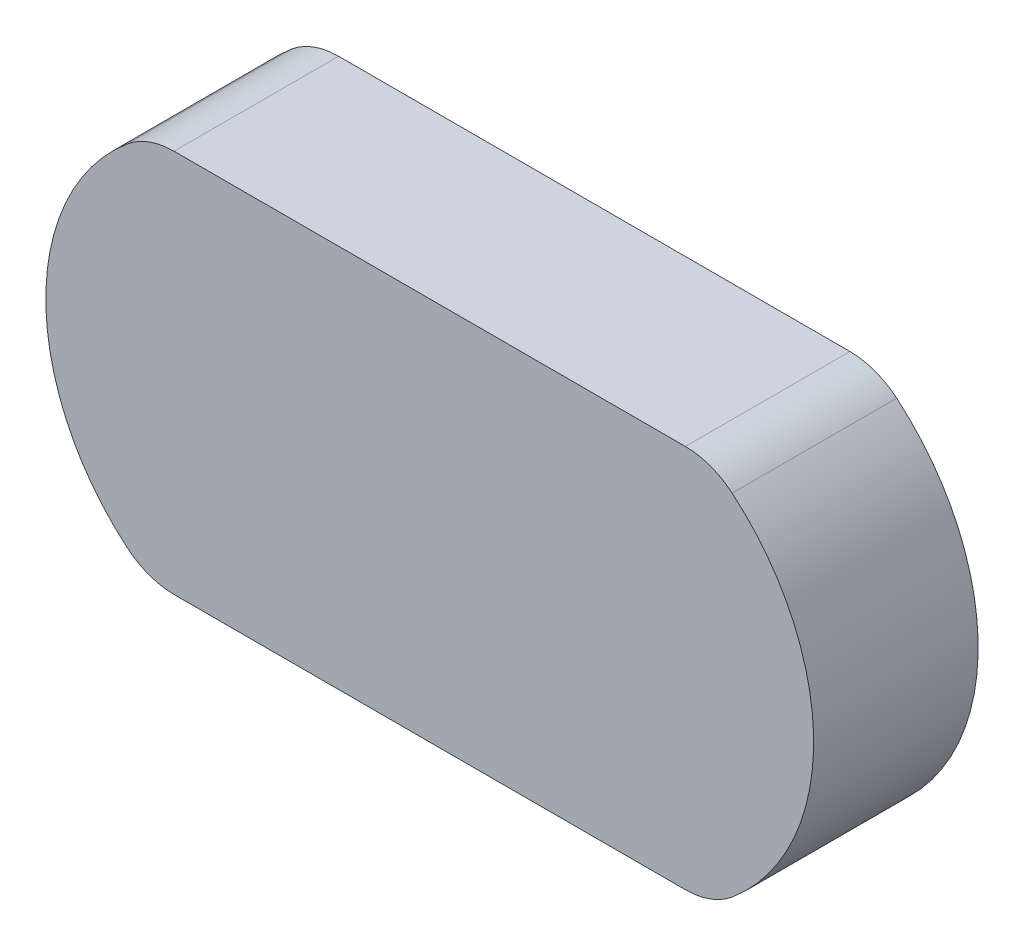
ISO-10303-21;
HEADER;
FILE_DESCRIPTION(('STEP AP214'),'2;1');
FILE_NAME('part.step','',(''),(''),'','','');
FILE_SCHEMA(('AUTOMOTIVE_DESIGN { 1 0 10303 214 1 1 1 1 }'));
ENDSEC;
DATA;
#1=APPLICATION_CONTEXT('core data for automotive mechanical design processes');
#2=APPLICATION_PROTOCOL_DEFINITION('international standard','automotive_design',2000,#1);
#3=PRODUCT_CONTEXT('',#1,'mechanical');
#4=PRODUCT('Part','Part','',(#3));
#5=PRODUCT_RELATED_PRODUCT_CATEGORY('part','',(#4));
#6=PRODUCT_DEFINITION_FORMATION('','',#4);
#7=PRODUCT_DEFINITION_CONTEXT('part definition',#1,'design');
#8=PRODUCT_DEFINITION('design','',#6,#7);
#9=PRODUCT_DEFINITION_SHAPE('','',#8);
#10=(LENGTH_UNIT() NAMED_UNIT(*) SI_UNIT(.MILLI.,.METRE.));
#11=(NAMED_UNIT(*) PLANE_ANGLE_UNIT() SI_UNIT($,.RADIAN.));
#12=(NAMED_UNIT(*) SI_UNIT($,.STERADIAN.) SOLID_ANGLE_UNIT());
#13=UNCERTAINTY_MEASURE_WITH_UNIT(LENGTH_MEASURE(1.E-05),#10,'distance_accuracy_value','');
#14=(GEOMETRIC_REPRESENTATION_CONTEXT(3) GLOBAL_UNCERTAINTY_ASSIGNED_CONTEXT((#13)) GLOBAL_UNIT_ASSIGNED_CONTEXT((#10,
#11,#12)) REPRESENTATION_CONTEXT('',''));
#15=CARTESIAN_POINT('',(0.,0.,0.));
#16=DIRECTION('',(0.,0.,1.));
#17=DIRECTION('',(1.,0.,0.));
#18=AXIS2_PLACEMENT_3D('',#15,#16,#17);
#19=CARTESIAN_POINT('',(-17.,0.,0.));
#20=DIRECTION('',(0.,0.,1.));
#21=DIRECTION('',(1.,0.,0.));
#22=AXIS2_PLACEMENT_3D('',#19,#20,#21);
#23=PLANE('',#22);
#24=CARTESIAN_POINT('',(-37.047,0.,0.000254));
#25=CARTESIAN_POINT('',(-37.047,-2.16612313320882,0.000254));
#26=CARTESIAN_POINT('',(-36.5841829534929,-4.28275460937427,0.000254));
#27=CARTESIAN_POINT('',(-36.1101866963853,-6.45051270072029,0.000254));
#28=CARTESIAN_POINT('',(-35.1730395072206,-8.46302806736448,0.000254));
#29=CARTESIAN_POINT('',(-34.2363311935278,-10.4746009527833,0.000254));
#30=CARTESIAN_POINT('',(-32.8816465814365,-12.2333769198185,0.000254));
#31=CARTESIAN_POINT('',(-31.5598433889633,-13.9494632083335,0.000254));
#32=CARTESIAN_POINT('',(-29.901507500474,-15.3438363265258,0.000254));
#33=B_SPLINE_CURVE_WITH_KNOTS('',2,(#24,#25,#26,#27,#28,#29,#30,#31,#32),.UNSPECIFIED.,.F.,.F.,
(3,2,2,2,3),(0.,0.25,0.5,0.75,1.),.UNSPECIFIED.);
#34=CARTESIAN_POINT('',(-37.047,0.,0.000127));
#35=VERTEX_POINT('',#34);
#36=CARTESIAN_POINT('',(-29.901507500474,-15.3438363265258,0.000127));
#37=VERTEX_POINT('',#36);
#38=EDGE_CURVE('E126',#35,#37,#33,.T.);
#39=ORIENTED_EDGE('',*,*,#38,.F.);
#40=CARTESIAN_POINT('',(-29.901507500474,15.3438363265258,0.000254));
#41=CARTESIAN_POINT('',(-31.559443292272,13.9497996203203,0.000254));
#42=CARTESIAN_POINT('',(-32.8816465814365,12.2333769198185,0.000254));
#43=CARTESIAN_POINT('',(-34.2357873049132,10.4754945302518,0.000254));
#44=CARTESIAN_POINT('',(-35.1730395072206,8.46302806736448,0.000254));
#45=CARTESIAN_POINT('',(-36.1098527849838,6.45150406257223,0.000254));
#46=CARTESIAN_POINT('',(-36.5841829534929,4.28275460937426,0.000254));
#47=CARTESIAN_POINT('',(-37.047,2.16664586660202,0.000254));
#48=CARTESIAN_POINT('',(-37.047,0.,0.000254));
#49=B_SPLINE_CURVE_WITH_KNOTS('',2,(#40,#41,#42,#43,#44,#45,#46,#47,#48),.UNSPECIFIED.,.F.,.F.,
(3,2,2,2,3),(0.,0.25,0.5,0.75,1.),.UNSPECIFIED.);
#50=CARTESIAN_POINT('',(-29.901507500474,15.3438363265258,0.000127));
#51=VERTEX_POINT('',#50);
#52=EDGE_CURVE('E185',#51,#35,#49,.T.);
#53=ORIENTED_EDGE('',*,*,#52,.F.);
#54=CARTESIAN_POINT('',(-27.9726204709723,16.047,0.000254));
#55=CARTESIAN_POINT('',(-28.5016152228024,16.047,0.000254));
#56=CARTESIAN_POINT('',(-28.9991491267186,15.8657273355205,0.000254));
#57=CARTESIAN_POINT('',(-29.4961979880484,15.6846313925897,0.000254));
#58=CARTESIAN_POINT('',(-29.901507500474,15.3438363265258,0.000254));
#59=B_SPLINE_CURVE_WITH_KNOTS('',2,(#54,#55,#56,#57,#58),.UNSPECIFIED.,.F.,.F.,(3,2,3),(0.,0.5,
1.),.UNSPECIFIED.);
#60=CARTESIAN_POINT('',(-27.9726204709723,16.047,0.000127));
#61=VERTEX_POINT('',#60);
#62=EDGE_CURVE('E187',#61,#51,#59,.T.);
#63=ORIENTED_EDGE('',*,*,#62,.F.);
#64=CARTESIAN_POINT('',(27.9726204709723,16.047,0.000254));
#65=DIRECTION('',(-1.,0.,0.));
#66=VECTOR('',#65,1.);
#67=LINE('',#64,#66);
#68=CARTESIAN_POINT('',(27.9726204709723,16.047,0.000127));
#69=VERTEX_POINT('',#68);
#70=EDGE_CURVE('E189',#69,#61,#67,.T.);
#71=ORIENTED_EDGE('',*,*,#70,.F.);
#72=CARTESIAN_POINT('',(29.901507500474,15.3438363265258,0.000254));
#73=CARTESIAN_POINT('',(29.4966185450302,15.6842777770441,0.000254));
#74=CARTESIAN_POINT('',(28.9991491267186,15.8657273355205,0.000254));
#75=CARTESIAN_POINT('',(28.5021646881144,16.047,0.000254));
#76=CARTESIAN_POINT('',(27.9726204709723,16.047,0.000254));
#77=B_SPLINE_CURVE_WITH_KNOTS('',2,(#72,#73,#74,#75,#76),.UNSPECIFIED.,.F.,.F.,(3,2,3),(0.,0.5,
1.),.UNSPECIFIED.);
#78=CARTESIAN_POINT('',(29.901507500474,15.3438363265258,0.000127));
#79=VERTEX_POINT('',#78);
#80=EDGE_CURVE('E190',#79,#69,#77,.T.);
#81=ORIENTED_EDGE('',*,*,#80,.F.);
#82=CARTESIAN_POINT('',(29.901507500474,-15.3438363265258,0.000254));
#83=CARTESIAN_POINT('',(31.55944329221,-13.9497996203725,0.000254));
#84=CARTESIAN_POINT('',(32.8816465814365,-12.2333769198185,0.000254));
#85=CARTESIAN_POINT('',(34.2357873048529,-10.4754945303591,0.000254));
#86=CARTESIAN_POINT('',(35.1730395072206,-8.46302806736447,0.000254));
#87=CARTESIAN_POINT('',(36.1098527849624,-6.45150406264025,0.000254));
#88=CARTESIAN_POINT('',(36.5841829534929,-4.28275460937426,0.000254));
#89=CARTESIAN_POINT('',(37.0469412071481,-2.16691468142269,0.000254));
#90=CARTESIAN_POINT('',(37.047,0.,0.000254));
#91=CARTESIAN_POINT('',(37.0470587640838,2.16585438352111,0.000254));
#92=CARTESIAN_POINT('',(36.5841829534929,4.28275460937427,0.000254));
#93=CARTESIAN_POINT('',(36.1101866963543,6.45051270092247,0.000254));
#94=CARTESIAN_POINT('',(35.1730395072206,8.46302806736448,0.000254));
#95=CARTESIAN_POINT('',(34.2363311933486,10.4746009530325,0.000254));
#96=CARTESIAN_POINT('',(32.8816465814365,12.2333769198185,0.000254));
#97=CARTESIAN_POINT('',(31.5598433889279,13.9494632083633,0.000254));
#98=CARTESIAN_POINT('',(29.901507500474,15.3438363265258,0.000254));
#99=B_SPLINE_CURVE_WITH_KNOTS('',2,(#82,#83,#84,#85,#86,#87,#88,#89,#90,#91,#92,#93,#94,#95,#96,
#97,#98),.UNSPECIFIED.,.F.,.F.,(3,2,2,2,2,2,2,2,3),(0.,0.125,0.25,0.375,0.5,0.625,0.75,0.875,
1.),.UNSPECIFIED.);
#100=CARTESIAN_POINT('',(29.901507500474,-15.3438363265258,0.000127));
#101=VERTEX_POINT('',#100);
#102=EDGE_CURVE('E193',#101,#79,#99,.T.);
#103=ORIENTED_EDGE('',*,*,#102,.F.);
#104=CARTESIAN_POINT('',(27.9726204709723,-16.047,0.000254));
#105=CARTESIAN_POINT('',(28.5016152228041,-16.047,0.000254));
#106=CARTESIAN_POINT('',(28.9991491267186,-15.8657273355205,0.000254));
#107=CARTESIAN_POINT('',(29.4961979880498,-15.6846313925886,0.000254));
#108=CARTESIAN_POINT('',(29.901507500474,-15.3438363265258,0.000254));
#109=B_SPLINE_CURVE_WITH_KNOTS('',2,(#104,#105,#106,#107,#108),.UNSPECIFIED.,.F.,.F.,(3,2,3),
(0.,0.5,1.),.UNSPECIFIED.);
#110=CARTESIAN_POINT('',(27.9726204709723,-16.047,0.000127));
#111=VERTEX_POINT('',#110);
#112=EDGE_CURVE('E114',#111,#101,#109,.T.);
#113=ORIENTED_EDGE('',*,*,#112,.F.);
#114=CARTESIAN_POINT('',(-27.9726204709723,-16.047,0.000254));
#115=DIRECTION('',(1.,0.,0.));
#116=VECTOR('',#115,1.);
#117=LINE('',#114,#116);
#118=CARTESIAN_POINT('',(-27.9726204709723,-16.047,0.000127));
#119=VERTEX_POINT('',#118);
#120=EDGE_CURVE('E117',#119,#111,#117,.T.);
#121=ORIENTED_EDGE('',*,*,#120,.F.);
#122=CARTESIAN_POINT('',(-29.901507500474,-15.3438363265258,0.000254));
#123=CARTESIAN_POINT('',(-29.4966185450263,-15.6842777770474,0.000254));
#124=CARTESIAN_POINT('',(-28.9991491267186,-15.8657273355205,0.000254));
#125=CARTESIAN_POINT('',(-28.5021646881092,-16.047,0.000254));
#126=CARTESIAN_POINT('',(-27.9726204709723,-16.047,0.000254));
#127=B_SPLINE_CURVE_WITH_KNOTS('',2,(#122,#123,#124,#125,#126),.UNSPECIFIED.,.F.,.F.,(3,2,3),
(0.,0.5,1.),.UNSPECIFIED.);
#128=EDGE_CURVE('E92',#37,#119,#127,.T.);
#129=ORIENTED_EDGE('',*,*,#128,.F.);
#130=EDGE_LOOP('',(#39,#53,#63,#71,#81,#103,#113,#121,#129));
#131=FACE_BOUND('',#130,.T.);
#132=ADVANCED_FACE('F16',(#131),#23,.F.);
#133=CARTESIAN_POINT('',(27.9726204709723,13.0498,0.000254));
#134=DIRECTION('',(0.,0.,-1.));
#135=DIRECTION('',(-1.,0.,0.));
#136=AXIS2_PLACEMENT_3D('',#133,#134,#135);
#137=PLANE('',#136);
#138=CARTESIAN_POINT('',(-27.9726204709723,13.0498,0.000254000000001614));
#139=DIRECTION('',(0.,0.,-1.));
#140=DIRECTION('',(-1.,0.,0.));
#141=AXIS2_PLACEMENT_3D('',#138,#139,#140);
#142=CIRCLE('',#141,7.9502);
#143=CARTESIAN_POINT('',(-27.9726204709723,21.,0.000254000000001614));
#144=VERTEX_POINT('',#143);
#145=CARTESIAN_POINT('',(-33.0890750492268,19.1348285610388,0.000254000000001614));
#146=VERTEX_POINT('',#145);
#147=EDGE_CURVE('E218',#144,#146,#142,.F.);
#148=ORIENTED_EDGE('',*,*,#147,.F.);
#149=DIRECTION('',(1.,0.,0.));
#150=VECTOR('',#149,1.);
#151=CARTESIAN_POINT('',(-30.5646599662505,21.,0.000254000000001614));
#152=LINE('',#151,#150);
#153=CARTESIAN_POINT('',(27.9726204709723,21.,0.000254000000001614));
#154=VERTEX_POINT('',#153);
#155=EDGE_CURVE('E135',#144,#154,#152,.T.);
#156=ORIENTED_EDGE('',*,*,#155,.T.);
#157=CARTESIAN_POINT('',(27.9726204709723,13.0498,0.000254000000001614));
#158=DIRECTION('',(0.,0.,-1.));
#159=DIRECTION('',(-1.,0.,0.));
#160=AXIS2_PLACEMENT_3D('',#157,#158,#159);
#161=CIRCLE('',#160,7.9502);
#162=CARTESIAN_POINT('',(33.0890750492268,19.1348285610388,0.000254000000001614));
#163=VERTEX_POINT('',#162);
#164=EDGE_CURVE('E214',#163,#154,#161,.F.);
#165=ORIENTED_EDGE('',*,*,#164,.F.);
#166=CARTESIAN_POINT('',(17.,0.,0.000254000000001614));
#167=DIRECTION('',(0.,0.,-1.));
#168=DIRECTION('',(-1.,0.,0.));
#169=AXIS2_PLACEMENT_3D('',#166,#167,#168);
#170=CIRCLE('',#169,25.);
#171=CARTESIAN_POINT('',(33.0890750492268,-19.1348285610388,0.000254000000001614));
#172=VERTEX_POINT('',#171);
#173=EDGE_CURVE('E211',#172,#163,#170,.F.);
#174=ORIENTED_EDGE('',*,*,#173,.F.);
#175=CARTESIAN_POINT('',(27.9726204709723,-13.0498,0.000254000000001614));
#176=DIRECTION('',(0.,0.,-1.));
#177=DIRECTION('',(-1.,0.,0.));
#178=AXIS2_PLACEMENT_3D('',#175,#176,#177);
#179=CIRCLE('',#178,7.9502);
#180=CARTESIAN_POINT('',(27.9726204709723,-21.,0.000254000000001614));
#181=VERTEX_POINT('',#180);
#182=EDGE_CURVE('E206',#181,#172,#179,.F.);
#183=ORIENTED_EDGE('',*,*,#182,.F.);
#184=DIRECTION('',(1.,0.,0.));
#185=VECTOR('',#184,1.);
#186=CARTESIAN_POINT('',(-30.5646599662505,-21.,0.000254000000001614));
#187=LINE('',#186,#185);
#188=CARTESIAN_POINT('',(-27.9726204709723,-21.,0.000254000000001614));
#189=VERTEX_POINT('',#188);
#190=EDGE_CURVE('E202',#181,#189,#187,.F.);
#191=ORIENTED_EDGE('',*,*,#190,.T.);
#192=CARTESIAN_POINT('',(-27.9726204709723,-13.0498,0.000254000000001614));
#193=DIRECTION('',(0.,0.,-1.));
#194=DIRECTION('',(-1.,0.,0.));
#195=AXIS2_PLACEMENT_3D('',#192,#193,#194);
#196=CIRCLE('',#195,7.9502);
#197=CARTESIAN_POINT('',(-33.0890750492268,-19.1348285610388,0.000254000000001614));
#198=VERTEX_POINT('',#197);
#199=EDGE_CURVE('E199',#198,#189,#196,.F.);
#200=ORIENTED_EDGE('',*,*,#199,.F.);
#201=CARTESIAN_POINT('',(-17.,0.,0.000254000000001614));
#202=DIRECTION('',(0.,0.,-1.));
#203=DIRECTION('',(-1.,0.,0.));
#204=AXIS2_PLACEMENT_3D('',#201,#202,#203);
#205=CIRCLE('',#204,25.);
#206=EDGE_CURVE('E20',#146,#198,#205,.F.);
#207=ORIENTED_EDGE('',*,*,#206,.F.);
#208=EDGE_LOOP('',(#148,#156,#165,#174,#183,#191,#200,#207));
#209=FACE_BOUND('',#208,.T.);
#210=ORIENTED_EDGE('',*,*,#38,.T.);
#211=ORIENTED_EDGE('',*,*,#128,.T.);
#212=ORIENTED_EDGE('',*,*,#120,.T.);
#213=ORIENTED_EDGE('',*,*,#112,.T.);
#214=ORIENTED_EDGE('',*,*,#102,.T.);
#215=ORIENTED_EDGE('',*,*,#80,.T.);
#216=ORIENTED_EDGE('',*,*,#70,.T.);
#217=ORIENTED_EDGE('',*,*,#62,.T.);
#218=ORIENTED_EDGE('',*,*,#52,.T.);
#219=EDGE_LOOP('',(#210,#211,#212,#213,#214,#215,#216,#217,#218));
#220=FACE_BOUND('',#219,.T.);
#221=ADVANCED_FACE('F124',(#209,#220),#137,.T.);
#222=CARTESIAN_POINT('',(-17.,0.,18.));
#223=DIRECTION('',(0.,0.,-1.));
#224=DIRECTION('',(-1.,0.,0.));
#225=AXIS2_PLACEMENT_3D('',#222,#223,#224);
#226=CYLINDRICAL_SURFACE('',#225,25.);
#227=ORIENTED_EDGE('',*,*,#206,.T.);
#228=DIRECTION('',(0.,0.,-1.));
#229=VECTOR('',#228,1.);
#230=CARTESIAN_POINT('',(-33.0890750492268,-19.1348285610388,18.));
#231=LINE('',#230,#229);
#232=CARTESIAN_POINT('',(-33.0890750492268,-19.1348285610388,18.));
#233=VERTEX_POINT('',#232);
#234=EDGE_CURVE('E196',#233,#198,#231,.T.);
#235=ORIENTED_EDGE('',*,*,#234,.F.);
#236=CARTESIAN_POINT('',(-17.,0.,18.));
#237=DIRECTION('',(0.,0.,-1.));
#238=DIRECTION('',(-1.,0.,0.));
#239=AXIS2_PLACEMENT_3D('',#236,#237,#238);
#240=CIRCLE('',#239,25.);
#241=CARTESIAN_POINT('',(-33.0890750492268,19.1348285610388,18.));
#242=VERTEX_POINT('',#241);
#243=EDGE_CURVE('E222',#242,#233,#240,.F.);
#244=ORIENTED_EDGE('',*,*,#243,.F.);
#245=DIRECTION('',(0.,0.,-1.));
#246=VECTOR('',#245,1.);
#247=CARTESIAN_POINT('',(-33.0890750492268,19.1348285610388,18.));
#248=LINE('',#247,#246);
#249=EDGE_CURVE('E219',#146,#242,#248,.F.);
#250=ORIENTED_EDGE('',*,*,#249,.F.);
#251=EDGE_LOOP('',(#227,#235,#244,#250));
#252=FACE_BOUND('',#251,.T.);
#253=ADVANCED_FACE('F145',(#252),#226,.T.);
#254=CARTESIAN_POINT('',(-27.9726204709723,-13.0498,18.));
#255=DIRECTION('',(0.,0.,-1.));
#256=DIRECTION('',(-1.,0.,0.));
#257=AXIS2_PLACEMENT_3D('',#254,#255,#256);
#258=CYLINDRICAL_SURFACE('',#257,7.9502);
#259=DIRECTION('',(0.,0.,1.));
#260=VECTOR('',#259,1.);
#261=CARTESIAN_POINT('',(-27.9726204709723,-21.,18.));
#262=LINE('',#261,#260);
#263=CARTESIAN_POINT('',(-27.9726204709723,-21.,18.));
#264=VERTEX_POINT('',#263);
#265=EDGE_CURVE('E200',#189,#264,#262,.T.);
#266=ORIENTED_EDGE('',*,*,#265,.T.);
#267=CARTESIAN_POINT('',(-27.9726204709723,-13.0498,18.));
#268=DIRECTION('',(0.,0.,-1.));
#269=DIRECTION('',(-1.,0.,0.));
#270=AXIS2_PLACEMENT_3D('',#267,#268,#269);
#271=CIRCLE('',#270,7.9502);
#272=EDGE_CURVE('E227',#233,#264,#271,.F.);
#273=ORIENTED_EDGE('',*,*,#272,.F.);
#274=ORIENTED_EDGE('',*,*,#234,.T.);
#275=ORIENTED_EDGE('',*,*,#199,.T.);
#276=EDGE_LOOP('',(#266,#273,#274,#275));
#277=FACE_BOUND('',#276,.T.);
#278=ADVANCED_FACE('F250',(#277),#258,.T.);
#279=CARTESIAN_POINT('',(-30.5646599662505,-21.,18.));
#280=DIRECTION('',(0.,1.,0.));
#281=DIRECTION('',(0.,0.,1.));
#282=AXIS2_PLACEMENT_3D('',#279,#280,#281);
#283=PLANE('',#282);
#284=DIRECTION('',(0.,0.,-1.));
#285=VECTOR('',#284,1.);
#286=CARTESIAN_POINT('',(27.9726204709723,-21.,18.));
#287=LINE('',#286,#285);
#288=CARTESIAN_POINT('',(27.9726204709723,-21.,18.));
#289=VERTEX_POINT('',#288);
#290=EDGE_CURVE('E203',#289,#181,#287,.T.);
#291=ORIENTED_EDGE('',*,*,#290,.F.);
#292=DIRECTION('',(1.,0.,0.));
#293=VECTOR('',#292,1.);
#294=CARTESIAN_POINT('',(-17.,-21.,18.));
#295=LINE('',#294,#293);
#296=EDGE_CURVE('E223',#264,#289,#295,.T.);
#297=ORIENTED_EDGE('',*,*,#296,.F.);
#298=ORIENTED_EDGE('',*,*,#265,.F.);
#299=ORIENTED_EDGE('',*,*,#190,.F.);
#300=EDGE_LOOP('',(#291,#297,#298,#299));
#301=FACE_BOUND('',#300,.T.);
#302=ADVANCED_FACE('F257',(#301),#283,.F.);
#303=CARTESIAN_POINT('',(27.9726204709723,-13.0498,18.));
#304=DIRECTION('',(0.,0.,-1.));
#305=DIRECTION('',(-1.,0.,0.));
#306=AXIS2_PLACEMENT_3D('',#303,#304,#305);
#307=CYLINDRICAL_SURFACE('',#306,7.9502);
#308=DIRECTION('',(0.,0.,-1.));
#309=VECTOR('',#308,1.);
#310=CARTESIAN_POINT('',(33.0890750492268,-19.1348285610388,18.));
#311=LINE('',#310,#309);
#312=CARTESIAN_POINT('',(33.0890750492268,-19.1348285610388,18.));
#313=VERTEX_POINT('',#312);
#314=EDGE_CURVE('E207',#313,#172,#311,.T.);
#315=ORIENTED_EDGE('',*,*,#314,.F.);
#316=CARTESIAN_POINT('',(27.9726204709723,-13.0498,18.));
#317=DIRECTION('',(0.,0.,-1.));
#318=DIRECTION('',(-1.,0.,0.));
#319=AXIS2_PLACEMENT_3D('',#316,#317,#318);
#320=CIRCLE('',#319,7.9502);
#321=EDGE_CURVE('E226',#289,#313,#320,.F.);
#322=ORIENTED_EDGE('',*,*,#321,.F.);
#323=ORIENTED_EDGE('',*,*,#290,.T.);
#324=ORIENTED_EDGE('',*,*,#182,.T.);
#325=EDGE_LOOP('',(#315,#322,#323,#324));
#326=FACE_BOUND('',#325,.T.);
#327=ADVANCED_FACE('F284',(#326),#307,.T.);
#328=CARTESIAN_POINT('',(17.,0.,18.));
#329=DIRECTION('',(0.,0.,-1.));
#330=DIRECTION('',(-1.,0.,0.));
#331=AXIS2_PLACEMENT_3D('',#328,#329,#330);
#332=CYLINDRICAL_SURFACE('',#331,25.);
#333=CARTESIAN_POINT('',(17.,0.,18.));
#334=DIRECTION('',(0.,0.,-1.));
#335=DIRECTION('',(-1.,0.,0.));
#336=AXIS2_PLACEMENT_3D('',#333,#334,#335);
#337=CIRCLE('',#336,25.);
#338=CARTESIAN_POINT('',(33.0890750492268,19.1348285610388,18.));
#339=VERTEX_POINT('',#338);
#340=EDGE_CURVE('E232',#313,#339,#337,.F.);
#341=ORIENTED_EDGE('',*,*,#340,.F.);
#342=ORIENTED_EDGE('',*,*,#314,.T.);
#343=ORIENTED_EDGE('',*,*,#173,.T.);
#344=DIRECTION('',(0.,0.,-1.));
#345=VECTOR('',#344,1.);
#346=CARTESIAN_POINT('',(33.0890750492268,19.1348285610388,18.));
#347=LINE('',#346,#345);
#348=EDGE_CURVE('E210',#339,#163,#347,.T.);
#349=ORIENTED_EDGE('',*,*,#348,.F.);
#350=EDGE_LOOP('',(#341,#342,#343,#349));
#351=FACE_BOUND('',#350,.T.);
#352=ADVANCED_FACE('F280',(#351),#332,.T.);
#353=CARTESIAN_POINT('',(27.9726204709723,13.0498,18.));
#354=DIRECTION('',(0.,0.,-1.));
#355=DIRECTION('',(-1.,0.,0.));
#356=AXIS2_PLACEMENT_3D('',#353,#354,#355);
#357=CYLINDRICAL_SURFACE('',#356,7.9502);
#358=DIRECTION('',(0.,0.,-1.));
#359=VECTOR('',#358,1.);
#360=CARTESIAN_POINT('',(27.9726204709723,21.,18.));
#361=LINE('',#360,#359);
#362=CARTESIAN_POINT('',(27.9726204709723,21.,18.));
#363=VERTEX_POINT('',#362);
#364=EDGE_CURVE('E215',#154,#363,#361,.F.);
#365=ORIENTED_EDGE('',*,*,#364,.T.);
#366=CARTESIAN_POINT('',(27.9726204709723,13.0498,18.));
#367=DIRECTION('',(0.,0.,-1.));
#368=DIRECTION('',(-1.,0.,0.));
#369=AXIS2_PLACEMENT_3D('',#366,#367,#368);
#370=CIRCLE('',#369,7.9502);
#371=EDGE_CURVE('E229',#339,#363,#370,.F.);
#372=ORIENTED_EDGE('',*,*,#371,.F.);
#373=ORIENTED_EDGE('',*,*,#348,.T.);
#374=ORIENTED_EDGE('',*,*,#164,.T.);
#375=EDGE_LOOP('',(#365,#372,#373,#374));
#376=FACE_BOUND('',#375,.T.);
#377=ADVANCED_FACE('F277',(#376),#357,.T.);
#378=CARTESIAN_POINT('',(-30.5646599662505,21.,18.));
#379=DIRECTION('',(0.,-1.,0.));
#380=DIRECTION('',(0.,0.,-1.));
#381=AXIS2_PLACEMENT_3D('',#378,#379,#380);
#382=PLANE('',#381);
#383=DIRECTION('',(0.,0.,-1.));
#384=VECTOR('',#383,1.);
#385=CARTESIAN_POINT('',(-27.9726204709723,21.,18.));
#386=LINE('',#385,#384);
#387=CARTESIAN_POINT('',(-27.9726204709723,21.,18.));
#388=VERTEX_POINT('',#387);
#389=EDGE_CURVE('E35',#388,#144,#386,.T.);
#390=ORIENTED_EDGE('',*,*,#389,.F.);
#391=DIRECTION('',(1.,0.,0.));
#392=VECTOR('',#391,1.);
#393=CARTESIAN_POINT('',(-17.,21.,18.));
#394=LINE('',#393,#392);
#395=EDGE_CURVE('E26',#363,#388,#394,.F.);
#396=ORIENTED_EDGE('',*,*,#395,.F.);
#397=ORIENTED_EDGE('',*,*,#364,.F.);
#398=ORIENTED_EDGE('',*,*,#155,.F.);
#399=EDGE_LOOP('',(#390,#396,#397,#398));
#400=FACE_BOUND('',#399,.T.);
#401=ADVANCED_FACE('F271',(#400),#382,.F.);
#402=CARTESIAN_POINT('',(-27.9726204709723,13.0498,18.));
#403=DIRECTION('',(0.,0.,-1.));
#404=DIRECTION('',(-1.,0.,0.));
#405=AXIS2_PLACEMENT_3D('',#402,#403,#404);
#406=CYLINDRICAL_SURFACE('',#405,7.9502);
#407=ORIENTED_EDGE('',*,*,#249,.T.);
#408=CARTESIAN_POINT('',(-27.9726204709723,13.0498,18.));
#409=DIRECTION('',(0.,0.,-1.));
#410=DIRECTION('',(-1.,0.,0.));
#411=AXIS2_PLACEMENT_3D('',#408,#409,#410);
#412=CIRCLE('',#411,7.9502);
#413=EDGE_CURVE('E11',#388,#242,#412,.F.);
#414=ORIENTED_EDGE('',*,*,#413,.F.);
#415=ORIENTED_EDGE('',*,*,#389,.T.);
#416=ORIENTED_EDGE('',*,*,#147,.T.);
#417=EDGE_LOOP('',(#407,#414,#415,#416));
#418=FACE_BOUND('',#417,.T.);
#419=ADVANCED_FACE('F266',(#418),#406,.T.);
#420=CARTESIAN_POINT('',(-17.,0.,18.));
#421=DIRECTION('',(0.,0.,1.));
#422=DIRECTION('',(1.,0.,0.));
#423=AXIS2_PLACEMENT_3D('',#420,#421,#422);
#424=PLANE('',#423);
#425=ORIENTED_EDGE('',*,*,#395,.T.);
#426=ORIENTED_EDGE('',*,*,#413,.T.);
#427=ORIENTED_EDGE('',*,*,#243,.T.);
#428=ORIENTED_EDGE('',*,*,#272,.T.);
#429=ORIENTED_EDGE('',*,*,#296,.T.);
#430=ORIENTED_EDGE('',*,*,#321,.T.);
#431=ORIENTED_EDGE('',*,*,#340,.T.);
#432=ORIENTED_EDGE('',*,*,#371,.T.);
#433=EDGE_LOOP('',(#425,#426,#427,#428,#429,#430,#431,#432));
#434=FACE_BOUND('',#433,.T.);
#435=ADVANCED_FACE('F259',(#434),#424,.T.);
#436=CLOSED_SHELL('',(#132,#221,#253,#278,#302,#327,#352,#377,#401,#419,#435));
#437=MANIFOLD_SOLID_BREP('B1',#436);
#438=ADVANCED_BREP_SHAPE_REPRESENTATION('',(#18,#437),#14);
#439=SHAPE_DEFINITION_REPRESENTATION(#9,#438);
ENDSEC;
END-ISO-10303-21;
